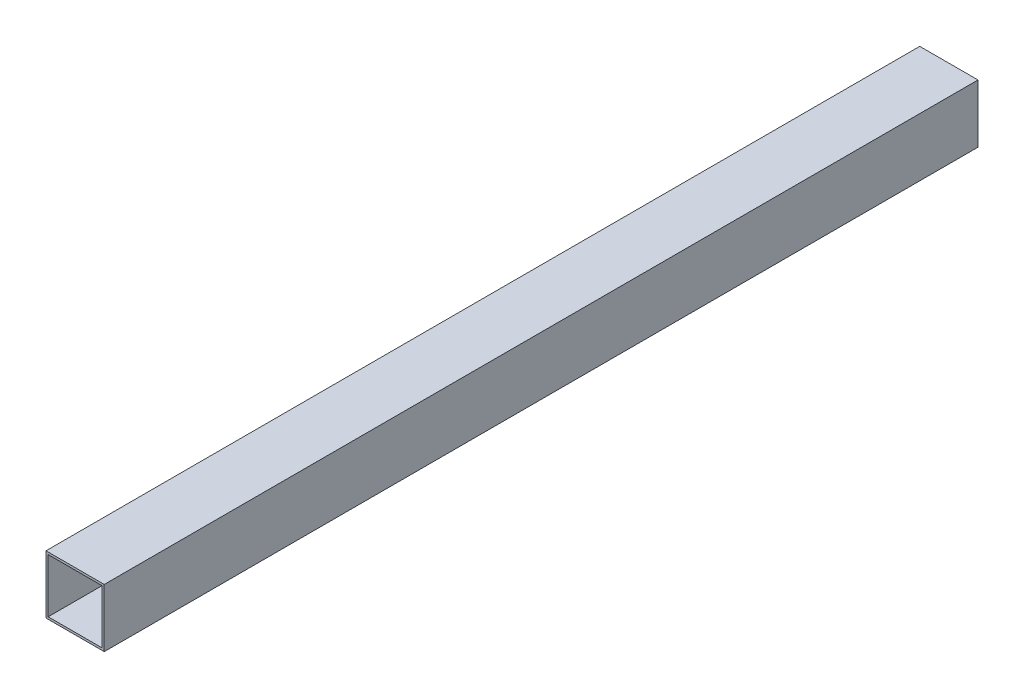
from build123d import *

# Parameters (mm, degrees)
ESQUISSE1_W      = 80
ESQUISSE1_H      = 80
ESQUISSE1_W_2    = 74
ESQUISSE1_H_2    = 74
EXTRUSION1_DEPTH = 1200


with BuildPart() as part:
    # Esquisse1 → Extrusion1 (new body)
    with BuildSketch(Plane.XY):
        with Locations((40, 40)):
            Rectangle(ESQUISSE1_W, ESQUISSE1_H)
        with Locations((40, 40)):
            Rectangle(ESQUISSE1_W_2, ESQUISSE1_H_2, mode=Mode.SUBTRACT)
    extrude(amount=EXTRUSION1_DEPTH)


solid = part.part
